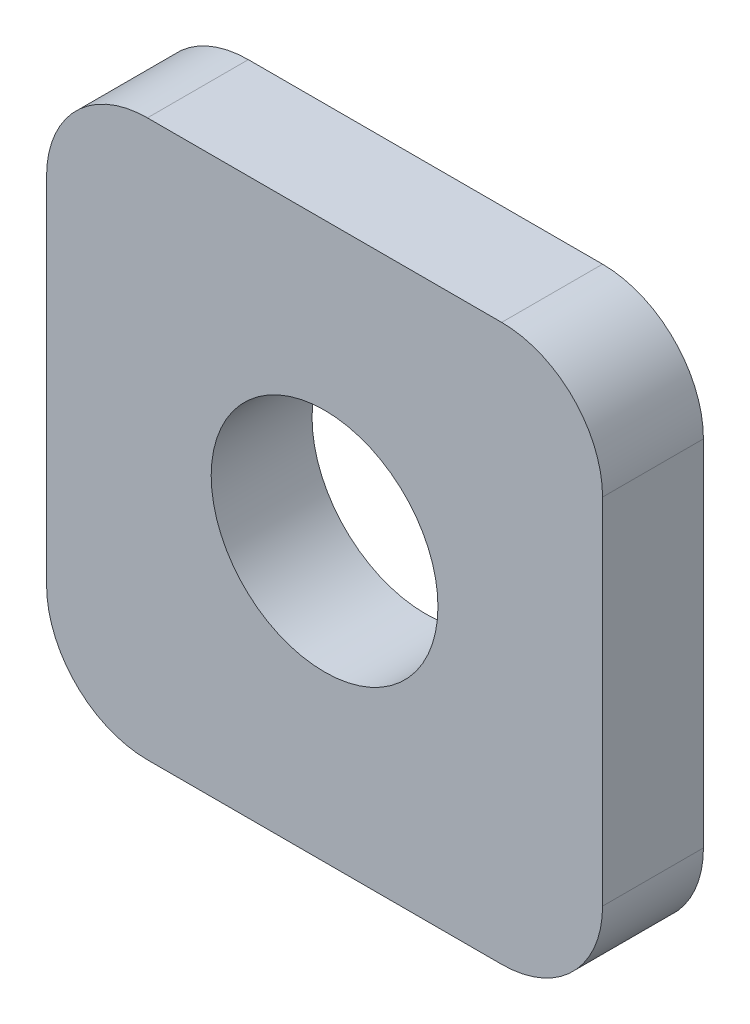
ISO-10303-21;
HEADER;
FILE_DESCRIPTION(('STEP AP214'),'2;1');
FILE_NAME('part.step','',(''),(''),'','','');
FILE_SCHEMA(('AUTOMOTIVE_DESIGN { 1 0 10303 214 1 1 1 1 }'));
ENDSEC;
DATA;
#1=APPLICATION_CONTEXT('core data for automotive mechanical design processes');
#2=APPLICATION_PROTOCOL_DEFINITION('international standard','automotive_design',2000,#1);
#3=PRODUCT_CONTEXT('',#1,'mechanical');
#4=PRODUCT('Part','Part','',(#3));
#5=PRODUCT_RELATED_PRODUCT_CATEGORY('part','',(#4));
#6=PRODUCT_DEFINITION_FORMATION('','',#4);
#7=PRODUCT_DEFINITION_CONTEXT('part definition',#1,'design');
#8=PRODUCT_DEFINITION('design','',#6,#7);
#9=PRODUCT_DEFINITION_SHAPE('','',#8);
#10=(LENGTH_UNIT() NAMED_UNIT(*) SI_UNIT(.MILLI.,.METRE.));
#11=(NAMED_UNIT(*) PLANE_ANGLE_UNIT() SI_UNIT($,.RADIAN.));
#12=(NAMED_UNIT(*) SI_UNIT($,.STERADIAN.) SOLID_ANGLE_UNIT());
#13=UNCERTAINTY_MEASURE_WITH_UNIT(LENGTH_MEASURE(1.E-05),#10,'distance_accuracy_value','');
#14=(GEOMETRIC_REPRESENTATION_CONTEXT(3) GLOBAL_UNCERTAINTY_ASSIGNED_CONTEXT((#13)) GLOBAL_UNIT_ASSIGNED_CONTEXT((#10,
#11,#12)) REPRESENTATION_CONTEXT('',''));
#15=CARTESIAN_POINT('',(0.,0.,0.));
#16=DIRECTION('',(0.,0.,1.));
#17=DIRECTION('',(1.,0.,0.));
#18=AXIS2_PLACEMENT_3D('',#15,#16,#17);
#19=CARTESIAN_POINT('',(11.15,-11.15,3.175));
#20=DIRECTION('',(0.,0.,1.));
#21=DIRECTION('',(1.,0.,0.));
#22=AXIS2_PLACEMENT_3D('',#19,#20,#21);
#23=PLANE('',#22);
#24=CARTESIAN_POINT('',(11.15,-11.15,3.175));
#25=DIRECTION('',(0.,0.,1.));
#26=DIRECTION('',(1.,0.,0.));
#27=AXIS2_PLACEMENT_3D('',#24,#25,#26);
#28=CIRCLE('',#27,6.35);
#29=CARTESIAN_POINT('',(11.15,-17.5,3.175));
#30=VERTEX_POINT('',#29);
#31=CARTESIAN_POINT('',(17.5,-11.15,3.175));
#32=VERTEX_POINT('',#31);
#33=EDGE_CURVE('E153',#30,#32,#28,.T.);
#34=ORIENTED_EDGE('',*,*,#33,.T.);
#35=DIRECTION('',(0.,1.,0.));
#36=VECTOR('',#35,1.);
#37=CARTESIAN_POINT('',(17.5,-11.15,3.175));
#38=LINE('',#37,#36);
#39=CARTESIAN_POINT('',(17.5,11.15,3.175));
#40=VERTEX_POINT('',#39);
#41=EDGE_CURVE('E101',#32,#40,#38,.T.);
#42=ORIENTED_EDGE('',*,*,#41,.T.);
#43=CARTESIAN_POINT('',(11.15,11.15,3.175));
#44=DIRECTION('',(0.,0.,1.));
#45=DIRECTION('',(1.,0.,0.));
#46=AXIS2_PLACEMENT_3D('',#43,#44,#45);
#47=CIRCLE('',#46,6.35);
#48=CARTESIAN_POINT('',(11.15,17.5,3.175));
#49=VERTEX_POINT('',#48);
#50=EDGE_CURVE('E169',#40,#49,#47,.T.);
#51=ORIENTED_EDGE('',*,*,#50,.T.);
#52=DIRECTION('',(-1.,0.,0.));
#53=VECTOR('',#52,1.);
#54=CARTESIAN_POINT('',(-11.15,17.5,3.175));
#55=LINE('',#54,#53);
#56=CARTESIAN_POINT('',(-11.15,17.5,3.175));
#57=VERTEX_POINT('',#56);
#58=EDGE_CURVE('E182',#49,#57,#55,.T.);
#59=ORIENTED_EDGE('',*,*,#58,.T.);
#60=CARTESIAN_POINT('',(-11.15,11.15,3.175));
#61=DIRECTION('',(0.,0.,1.));
#62=DIRECTION('',(-1.,0.,0.));
#63=AXIS2_PLACEMENT_3D('',#60,#61,#62);
#64=CIRCLE('',#63,6.35);
#65=CARTESIAN_POINT('',(-17.5,11.15,3.175));
#66=VERTEX_POINT('',#65);
#67=EDGE_CURVE('E118',#57,#66,#64,.T.);
#68=ORIENTED_EDGE('',*,*,#67,.T.);
#69=DIRECTION('',(0.,-1.,0.));
#70=VECTOR('',#69,1.);
#71=CARTESIAN_POINT('',(-17.5,-11.15,3.175));
#72=LINE('',#71,#70);
#73=CARTESIAN_POINT('',(-17.5,-11.15,3.175));
#74=VERTEX_POINT('',#73);
#75=EDGE_CURVE('E111',#66,#74,#72,.T.);
#76=ORIENTED_EDGE('',*,*,#75,.T.);
#77=CARTESIAN_POINT('',(-11.15,-11.15,3.175));
#78=DIRECTION('',(0.,0.,1.));
#79=DIRECTION('',(1.,0.,0.));
#80=AXIS2_PLACEMENT_3D('',#77,#78,#79);
#81=CIRCLE('',#80,6.35);
#82=CARTESIAN_POINT('',(-11.15,-17.5,3.175));
#83=VERTEX_POINT('',#82);
#84=EDGE_CURVE('E119',#74,#83,#81,.T.);
#85=ORIENTED_EDGE('',*,*,#84,.T.);
#86=DIRECTION('',(1.,0.,0.));
#87=VECTOR('',#86,1.);
#88=CARTESIAN_POINT('',(-11.15,-17.5,3.175));
#89=LINE('',#88,#87);
#90=EDGE_CURVE('E59',#83,#30,#89,.T.);
#91=ORIENTED_EDGE('',*,*,#90,.T.);
#92=EDGE_LOOP('',(#34,#42,#51,#59,#68,#76,#85,#91));
#93=FACE_BOUND('',#92,.T.);
#94=CARTESIAN_POINT('',(0.,0.,3.175));
#95=DIRECTION('',(0.,0.,1.));
#96=DIRECTION('',(1.,0.,0.));
#97=AXIS2_PLACEMENT_3D('',#94,#95,#96);
#98=CIRCLE('',#97,7.1374);
#99=CARTESIAN_POINT('',(7.1374,0.,3.175));
#100=VERTEX_POINT('',#99);
#101=EDGE_CURVE('E142',#100,#100,#98,.T.);
#102=ORIENTED_EDGE('',*,*,#101,.F.);
#103=EDGE_LOOP('',(#102));
#104=FACE_BOUND('',#103,.T.);
#105=ADVANCED_FACE('F41',(#93,#104),#23,.T.);
#106=CARTESIAN_POINT('',(11.15,-11.15,-3.175));
#107=DIRECTION('',(0.,0.,1.));
#108=DIRECTION('',(1.,0.,0.));
#109=AXIS2_PLACEMENT_3D('',#106,#107,#108);
#110=PLANE('',#109);
#111=CARTESIAN_POINT('',(11.15,-11.15,-3.175));
#112=DIRECTION('',(0.,0.,1.));
#113=DIRECTION('',(1.,0.,0.));
#114=AXIS2_PLACEMENT_3D('',#111,#112,#113);
#115=CIRCLE('',#114,6.35);
#116=CARTESIAN_POINT('',(11.15,-17.5,-3.175));
#117=VERTEX_POINT('',#116);
#118=CARTESIAN_POINT('',(17.5,-11.15,-3.175));
#119=VERTEX_POINT('',#118);
#120=EDGE_CURVE('E138',#117,#119,#115,.T.);
#121=ORIENTED_EDGE('',*,*,#120,.F.);
#122=DIRECTION('',(1.,0.,0.));
#123=VECTOR('',#122,1.);
#124=CARTESIAN_POINT('',(-11.15,-17.5,-3.175));
#125=LINE('',#124,#123);
#126=CARTESIAN_POINT('',(-11.15,-17.5,-3.175));
#127=VERTEX_POINT('',#126);
#128=EDGE_CURVE('E91',#127,#117,#125,.T.);
#129=ORIENTED_EDGE('',*,*,#128,.F.);
#130=CARTESIAN_POINT('',(-11.15,-11.15,-3.175));
#131=DIRECTION('',(0.,0.,1.));
#132=DIRECTION('',(1.,0.,0.));
#133=AXIS2_PLACEMENT_3D('',#130,#131,#132);
#134=CIRCLE('',#133,6.35);
#135=CARTESIAN_POINT('',(-17.5,-11.15,-3.175));
#136=VERTEX_POINT('',#135);
#137=EDGE_CURVE('E87',#136,#127,#134,.T.);
#138=ORIENTED_EDGE('',*,*,#137,.F.);
#139=DIRECTION('',(0.,-1.,0.));
#140=VECTOR('',#139,1.);
#141=CARTESIAN_POINT('',(-17.5,-11.15,-3.175));
#142=LINE('',#141,#140);
#143=CARTESIAN_POINT('',(-17.5,11.15,-3.175));
#144=VERTEX_POINT('',#143);
#145=EDGE_CURVE('E126',#144,#136,#142,.T.);
#146=ORIENTED_EDGE('',*,*,#145,.F.);
#147=CARTESIAN_POINT('',(-11.15,11.15,-3.175));
#148=DIRECTION('',(0.,0.,1.));
#149=DIRECTION('',(-1.,0.,0.));
#150=AXIS2_PLACEMENT_3D('',#147,#148,#149);
#151=CIRCLE('',#150,6.35);
#152=CARTESIAN_POINT('',(-11.15,17.5,-3.175));
#153=VERTEX_POINT('',#152);
#154=EDGE_CURVE('E146',#153,#144,#151,.T.);
#155=ORIENTED_EDGE('',*,*,#154,.F.);
#156=DIRECTION('',(-1.,0.,0.));
#157=VECTOR('',#156,1.);
#158=CARTESIAN_POINT('',(-11.15,17.5,-3.175));
#159=LINE('',#158,#157);
#160=CARTESIAN_POINT('',(11.15,17.5,-3.175));
#161=VERTEX_POINT('',#160);
#162=EDGE_CURVE('E148',#161,#153,#159,.T.);
#163=ORIENTED_EDGE('',*,*,#162,.F.);
#164=CARTESIAN_POINT('',(11.15,11.15,-3.175));
#165=DIRECTION('',(0.,0.,1.));
#166=DIRECTION('',(1.,0.,0.));
#167=AXIS2_PLACEMENT_3D('',#164,#165,#166);
#168=CIRCLE('',#167,6.35);
#169=CARTESIAN_POINT('',(17.5,11.15,-3.175));
#170=VERTEX_POINT('',#169);
#171=EDGE_CURVE('E145',#170,#161,#168,.T.);
#172=ORIENTED_EDGE('',*,*,#171,.F.);
#173=DIRECTION('',(0.,1.,0.));
#174=VECTOR('',#173,1.);
#175=CARTESIAN_POINT('',(17.5,-11.15,-3.175));
#176=LINE('',#175,#174);
#177=EDGE_CURVE('E143',#119,#170,#176,.T.);
#178=ORIENTED_EDGE('',*,*,#177,.F.);
#179=EDGE_LOOP('',(#121,#129,#138,#146,#155,#163,#172,#178));
#180=FACE_BOUND('',#179,.T.);
#181=CARTESIAN_POINT('',(0.,0.,-3.175));
#182=DIRECTION('',(0.,0.,1.));
#183=DIRECTION('',(1.,0.,0.));
#184=AXIS2_PLACEMENT_3D('',#181,#182,#183);
#185=CIRCLE('',#184,7.1374);
#186=CARTESIAN_POINT('',(7.1374,0.,-3.175));
#187=VERTEX_POINT('',#186);
#188=EDGE_CURVE('E190',#187,#187,#185,.T.);
#189=ORIENTED_EDGE('',*,*,#188,.T.);
#190=EDGE_LOOP('',(#189));
#191=FACE_BOUND('',#190,.T.);
#192=ADVANCED_FACE('F175',(#180,#191),#110,.F.);
#193=CARTESIAN_POINT('',(11.15,-11.15,3.175));
#194=DIRECTION('',(0.,0.,-1.));
#195=DIRECTION('',(-1.,0.,0.));
#196=AXIS2_PLACEMENT_3D('',#193,#194,#195);
#197=CYLINDRICAL_SURFACE('',#196,6.35);
#198=ORIENTED_EDGE('',*,*,#120,.T.);
#199=DIRECTION('',(0.,0.,-1.));
#200=VECTOR('',#199,1.);
#201=CARTESIAN_POINT('',(17.5,-11.15,3.175));
#202=LINE('',#201,#200);
#203=EDGE_CURVE('E11',#32,#119,#202,.T.);
#204=ORIENTED_EDGE('',*,*,#203,.F.);
#205=ORIENTED_EDGE('',*,*,#33,.F.);
#206=DIRECTION('',(0.,0.,-1.));
#207=VECTOR('',#206,1.);
#208=CARTESIAN_POINT('',(11.15,-17.5,3.175));
#209=LINE('',#208,#207);
#210=EDGE_CURVE('E131',#30,#117,#209,.T.);
#211=ORIENTED_EDGE('',*,*,#210,.T.);
#212=EDGE_LOOP('',(#198,#204,#205,#211));
#213=FACE_BOUND('',#212,.T.);
#214=ADVANCED_FACE('F43',(#213),#197,.T.);
#215=CARTESIAN_POINT('',(17.5,-11.15,3.175));
#216=DIRECTION('',(-1.,0.,0.));
#217=DIRECTION('',(0.,0.,1.));
#218=AXIS2_PLACEMENT_3D('',#215,#216,#217);
#219=PLANE('',#218);
#220=ORIENTED_EDGE('',*,*,#177,.T.);
#221=DIRECTION('',(0.,0.,-1.));
#222=VECTOR('',#221,1.);
#223=CARTESIAN_POINT('',(17.5,11.15,3.175));
#224=LINE('',#223,#222);
#225=EDGE_CURVE('E49',#40,#170,#224,.T.);
#226=ORIENTED_EDGE('',*,*,#225,.F.);
#227=ORIENTED_EDGE('',*,*,#41,.F.);
#228=ORIENTED_EDGE('',*,*,#203,.T.);
#229=EDGE_LOOP('',(#220,#226,#227,#228));
#230=FACE_BOUND('',#229,.T.);
#231=ADVANCED_FACE('F214',(#230),#219,.F.);
#232=CARTESIAN_POINT('',(11.15,11.15,3.175));
#233=DIRECTION('',(0.,0.,-1.));
#234=DIRECTION('',(-1.,0.,0.));
#235=AXIS2_PLACEMENT_3D('',#232,#233,#234);
#236=CYLINDRICAL_SURFACE('',#235,6.35);
#237=ORIENTED_EDGE('',*,*,#171,.T.);
#238=DIRECTION('',(0.,0.,-1.));
#239=VECTOR('',#238,1.);
#240=CARTESIAN_POINT('',(11.15,17.5,3.175));
#241=LINE('',#240,#239);
#242=EDGE_CURVE('E159',#49,#161,#241,.T.);
#243=ORIENTED_EDGE('',*,*,#242,.F.);
#244=ORIENTED_EDGE('',*,*,#50,.F.);
#245=ORIENTED_EDGE('',*,*,#225,.T.);
#246=EDGE_LOOP('',(#237,#243,#244,#245));
#247=FACE_BOUND('',#246,.T.);
#248=ADVANCED_FACE('F167',(#247),#236,.T.);
#249=CARTESIAN_POINT('',(-11.15,17.5,3.175));
#250=DIRECTION('',(0.,-1.,0.));
#251=DIRECTION('',(1.,0.,0.));
#252=AXIS2_PLACEMENT_3D('',#249,#250,#251);
#253=PLANE('',#252);
#254=ORIENTED_EDGE('',*,*,#162,.T.);
#255=DIRECTION('',(0.,0.,-1.));
#256=VECTOR('',#255,1.);
#257=CARTESIAN_POINT('',(-11.15,17.5,3.175));
#258=LINE('',#257,#256);
#259=EDGE_CURVE('E160',#57,#153,#258,.T.);
#260=ORIENTED_EDGE('',*,*,#259,.F.);
#261=ORIENTED_EDGE('',*,*,#58,.F.);
#262=ORIENTED_EDGE('',*,*,#242,.T.);
#263=EDGE_LOOP('',(#254,#260,#261,#262));
#264=FACE_BOUND('',#263,.T.);
#265=ADVANCED_FACE('F180',(#264),#253,.F.);
#266=CARTESIAN_POINT('',(-11.15,11.15,3.175));
#267=DIRECTION('',(0.,0.,-1.));
#268=DIRECTION('',(-1.,0.,0.));
#269=AXIS2_PLACEMENT_3D('',#266,#267,#268);
#270=CYLINDRICAL_SURFACE('',#269,6.35);
#271=ORIENTED_EDGE('',*,*,#154,.T.);
#272=DIRECTION('',(0.,0.,-1.));
#273=VECTOR('',#272,1.);
#274=CARTESIAN_POINT('',(-17.5,11.15,3.175));
#275=LINE('',#274,#273);
#276=EDGE_CURVE('E129',#66,#144,#275,.T.);
#277=ORIENTED_EDGE('',*,*,#276,.F.);
#278=ORIENTED_EDGE('',*,*,#67,.F.);
#279=ORIENTED_EDGE('',*,*,#259,.T.);
#280=EDGE_LOOP('',(#271,#277,#278,#279));
#281=FACE_BOUND('',#280,.T.);
#282=ADVANCED_FACE('F179',(#281),#270,.T.);
#283=CARTESIAN_POINT('',(-17.5,-11.15,3.175));
#284=DIRECTION('',(1.,0.,0.));
#285=DIRECTION('',(0.,0.,-1.));
#286=AXIS2_PLACEMENT_3D('',#283,#284,#285);
#287=PLANE('',#286);
#288=ORIENTED_EDGE('',*,*,#145,.T.);
#289=DIRECTION('',(0.,0.,-1.));
#290=VECTOR('',#289,1.);
#291=CARTESIAN_POINT('',(-17.5,-11.15,3.175));
#292=LINE('',#291,#290);
#293=EDGE_CURVE('E124',#74,#136,#292,.T.);
#294=ORIENTED_EDGE('',*,*,#293,.F.);
#295=ORIENTED_EDGE('',*,*,#75,.F.);
#296=ORIENTED_EDGE('',*,*,#276,.T.);
#297=EDGE_LOOP('',(#288,#294,#295,#296));
#298=FACE_BOUND('',#297,.T.);
#299=ADVANCED_FACE('F127',(#298),#287,.F.);
#300=CARTESIAN_POINT('',(-11.15,-11.15,3.175));
#301=DIRECTION('',(0.,0.,-1.));
#302=DIRECTION('',(-1.,0.,0.));
#303=AXIS2_PLACEMENT_3D('',#300,#301,#302);
#304=CYLINDRICAL_SURFACE('',#303,6.35);
#305=ORIENTED_EDGE('',*,*,#137,.T.);
#306=DIRECTION('',(0.,0.,-1.));
#307=VECTOR('',#306,1.);
#308=CARTESIAN_POINT('',(-11.15,-17.5,3.175));
#309=LINE('',#308,#307);
#310=EDGE_CURVE('E128',#83,#127,#309,.T.);
#311=ORIENTED_EDGE('',*,*,#310,.F.);
#312=ORIENTED_EDGE('',*,*,#84,.F.);
#313=ORIENTED_EDGE('',*,*,#293,.T.);
#314=EDGE_LOOP('',(#305,#311,#312,#313));
#315=FACE_BOUND('',#314,.T.);
#316=ADVANCED_FACE('F135',(#315),#304,.T.);
#317=CARTESIAN_POINT('',(-11.15,-17.5,3.175));
#318=DIRECTION('',(0.,1.,0.));
#319=DIRECTION('',(-1.,0.,0.));
#320=AXIS2_PLACEMENT_3D('',#317,#318,#319);
#321=PLANE('',#320);
#322=ORIENTED_EDGE('',*,*,#128,.T.);
#323=ORIENTED_EDGE('',*,*,#210,.F.);
#324=ORIENTED_EDGE('',*,*,#90,.F.);
#325=ORIENTED_EDGE('',*,*,#310,.T.);
#326=EDGE_LOOP('',(#322,#323,#324,#325));
#327=FACE_BOUND('',#326,.T.);
#328=ADVANCED_FACE('F201',(#327),#321,.F.);
#329=CARTESIAN_POINT('',(0.,0.,3.175));
#330=DIRECTION('',(0.,0.,-1.));
#331=DIRECTION('',(-1.,0.,0.));
#332=AXIS2_PLACEMENT_3D('',#329,#330,#331);
#333=CYLINDRICAL_SURFACE('',#332,7.1374);
#334=ORIENTED_EDGE('',*,*,#101,.T.);
#335=EDGE_LOOP('',(#334));
#336=FACE_BOUND('',#335,.T.);
#337=ORIENTED_EDGE('',*,*,#188,.F.);
#338=EDGE_LOOP('',(#337));
#339=FACE_BOUND('',#338,.T.);
#340=ADVANCED_FACE('F193',(#336,#339),#333,.F.);
#341=CLOSED_SHELL('',(#105,#192,#214,#231,#248,#265,#282,#299,#316,#328,#340));
#342=MANIFOLD_SOLID_BREP('B2',#341);
#343=ADVANCED_BREP_SHAPE_REPRESENTATION('',(#18,#342),#14);
#344=SHAPE_DEFINITION_REPRESENTATION(#9,#343);
ENDSEC;
END-ISO-10303-21;
